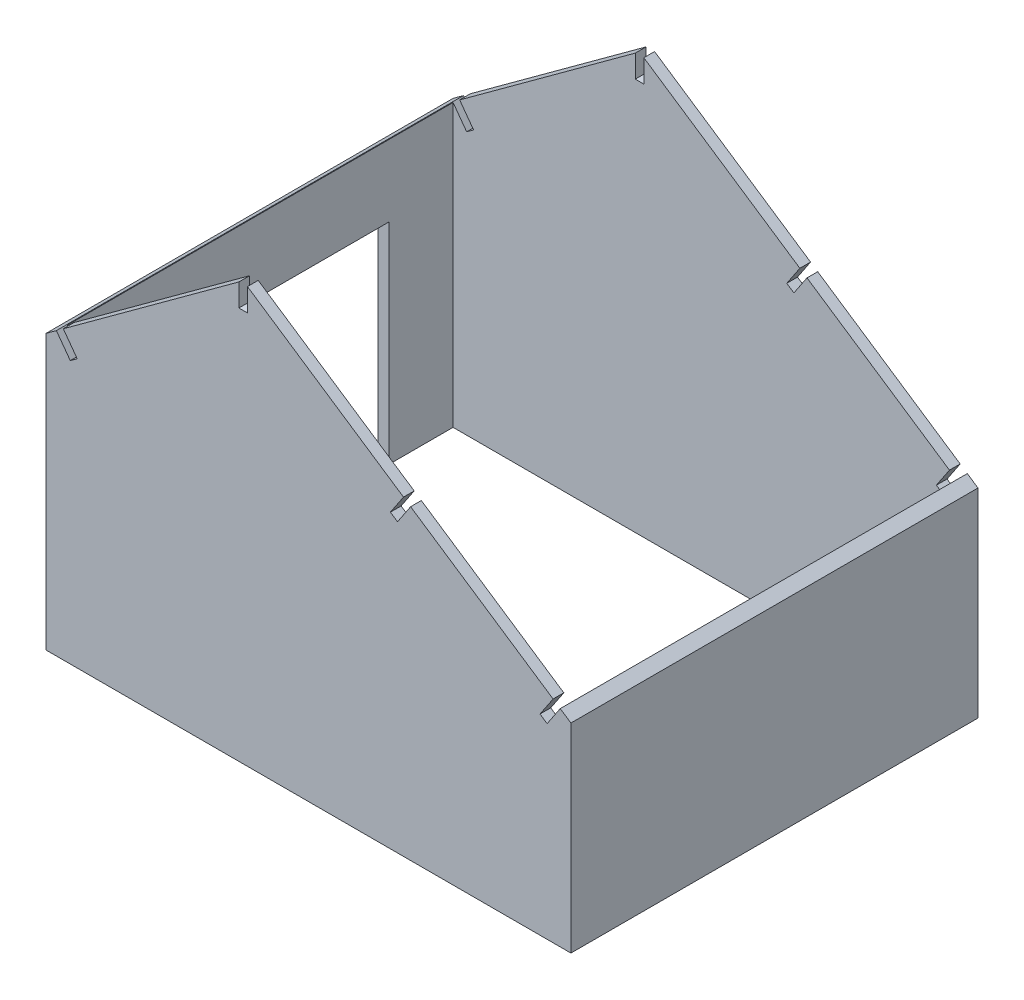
ISO-10303-21;
HEADER;
FILE_DESCRIPTION(('STEP AP214'),'2;1');
FILE_NAME('part.step','',(''),(''),'','','');
FILE_SCHEMA(('AUTOMOTIVE_DESIGN { 1 0 10303 214 1 1 1 1 }'));
ENDSEC;
DATA;
#1=APPLICATION_CONTEXT('core data for automotive mechanical design processes');
#2=APPLICATION_PROTOCOL_DEFINITION('international standard','automotive_design',2000,#1);
#3=PRODUCT_CONTEXT('',#1,'mechanical');
#4=PRODUCT('Part','Part','',(#3));
#5=PRODUCT_RELATED_PRODUCT_CATEGORY('part','',(#4));
#6=PRODUCT_DEFINITION_FORMATION('','',#4);
#7=PRODUCT_DEFINITION_CONTEXT('part definition',#1,'design');
#8=PRODUCT_DEFINITION('design','',#6,#7);
#9=PRODUCT_DEFINITION_SHAPE('','',#8);
#10=(LENGTH_UNIT() NAMED_UNIT(*) SI_UNIT(.MILLI.,.METRE.));
#11=(NAMED_UNIT(*) PLANE_ANGLE_UNIT() SI_UNIT($,.RADIAN.));
#12=(NAMED_UNIT(*) SI_UNIT($,.STERADIAN.) SOLID_ANGLE_UNIT());
#13=UNCERTAINTY_MEASURE_WITH_UNIT(LENGTH_MEASURE(1.E-05),#10,'distance_accuracy_value','');
#14=(GEOMETRIC_REPRESENTATION_CONTEXT(3) GLOBAL_UNCERTAINTY_ASSIGNED_CONTEXT((#13)) GLOBAL_UNIT_ASSIGNED_CONTEXT((#10,
#11,#12)) REPRESENTATION_CONTEXT('',''));
#15=CARTESIAN_POINT('',(0.,0.,0.));
#16=DIRECTION('',(0.,0.,1.));
#17=DIRECTION('',(1.,0.,0.));
#18=AXIS2_PLACEMENT_3D('',#15,#16,#17);
#19=CARTESIAN_POINT('',(152.961740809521,20.1138178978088,-5.));
#20=DIRECTION('',(0.555803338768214,0.831313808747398,0.));
#21=DIRECTION('',(-0.831313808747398,0.555803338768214,0.));
#22=AXIS2_PLACEMENT_3D('',#19,#20,#21);
#23=PLANE('',#22);
#24=DIRECTION('',(0.831313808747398,-0.555803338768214,0.));
#25=VECTOR('',#24,1.);
#26=CARTESIAN_POINT('',(147.961740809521,23.4567392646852,-190.));
#27=LINE('',#26,#25);
#28=CARTESIAN_POINT('',(2.00000000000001,121.04446368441,-190.));
#29=VERTEX_POINT('',#28);
#30=CARTESIAN_POINT('',(74.8182427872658,72.359331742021,-190.));
#31=VERTEX_POINT('',#30);
#32=EDGE_CURVE('E465',#29,#31,#27,.T.);
#33=ORIENTED_EDGE('',*,*,#32,.F.);
#34=DIRECTION('',(0.,0.,1.));
#35=VECTOR('',#34,1.);
#36=CARTESIAN_POINT('',(2.,121.04446368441,-5.));
#37=LINE('',#36,#35);
#38=CARTESIAN_POINT('',(2.,121.04446368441,-185.));
#39=VERTEX_POINT('',#38);
#40=EDGE_CURVE('E300',#29,#39,#37,.T.);
#41=ORIENTED_EDGE('',*,*,#40,.T.);
#42=DIRECTION('',(0.831313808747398,-0.555803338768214,0.));
#43=VECTOR('',#42,1.);
#44=CARTESIAN_POINT('',(147.961740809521,23.4567392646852,-185.));
#45=LINE('',#44,#43);
#46=CARTESIAN_POINT('',(74.8182427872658,72.359331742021,-185.));
#47=VERTEX_POINT('',#46);
#48=EDGE_CURVE('E456',#39,#47,#45,.T.);
#49=ORIENTED_EDGE('',*,*,#48,.T.);
#50=DIRECTION('',(0.,0.,1.));
#51=VECTOR('',#50,1.);
#52=CARTESIAN_POINT('',(74.8182427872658,72.359331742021,5.86249938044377));
#53=LINE('',#52,#51);
#54=EDGE_CURVE('E326',#31,#47,#53,.T.);
#55=ORIENTED_EDGE('',*,*,#54,.F.);
#56=EDGE_LOOP('',(#33,#41,#49,#55));
#57=FACE_BOUND('',#56,.T.);
#58=ADVANCED_FACE('F26',(#57),#23,.T.);
#59=CARTESIAN_POINT('',(0.,122.38163223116,-5.));
#60=DIRECTION('',(-0.590068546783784,0.807353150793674,0.));
#61=DIRECTION('',(-0.807353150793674,-0.590068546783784,0.));
#62=AXIS2_PLACEMENT_3D('',#59,#60,#61);
#63=PLANE('',#62);
#64=DIRECTION('',(-0.807353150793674,-0.590068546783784,0.));
#65=VECTOR('',#64,1.);
#66=CARTESIAN_POINT('',(0.,122.38163223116,0.));
#67=LINE('',#66,#65);
#68=CARTESIAN_POINT('',(-2.00000000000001,120.919896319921,0.));
#69=VERTEX_POINT('',#68);
#70=CARTESIAN_POINT('',(-83.9647276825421,61.0145033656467,0.));
#71=VERTEX_POINT('',#70);
#72=EDGE_CURVE('E681',#69,#71,#67,.T.);
#73=ORIENTED_EDGE('',*,*,#72,.F.);
#74=DIRECTION('',(0.,0.,-1.));
#75=VECTOR('',#74,1.);
#76=CARTESIAN_POINT('',(-2.00000000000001,120.919896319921,-5.));
#77=LINE('',#76,#75);
#78=CARTESIAN_POINT('',(-2.00000000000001,120.919896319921,-5.));
#79=VERTEX_POINT('',#78);
#80=EDGE_CURVE('E317',#69,#79,#77,.T.);
#81=ORIENTED_EDGE('',*,*,#80,.T.);
#82=DIRECTION('',(-0.807353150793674,-0.590068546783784,0.));
#83=VECTOR('',#82,1.);
#84=CARTESIAN_POINT('',(0.,122.38163223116,-5.));
#85=LINE('',#84,#83);
#86=CARTESIAN_POINT('',(-83.9647276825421,61.0145033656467,-5.));
#87=VERTEX_POINT('',#86);
#88=EDGE_CURVE('E315',#79,#87,#85,.T.);
#89=ORIENTED_EDGE('',*,*,#88,.T.);
#90=DIRECTION('',(0.,0.,-1.));
#91=VECTOR('',#90,1.);
#92=CARTESIAN_POINT('',(-83.9647276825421,61.0145033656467,4.99344607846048));
#93=LINE('',#92,#91);
#94=EDGE_CURVE('E394',#71,#87,#93,.T.);
#95=ORIENTED_EDGE('',*,*,#94,.F.);
#96=EDGE_LOOP('',(#73,#81,#89,#95));
#97=FACE_BOUND('',#96,.T.);
#98=ADVANCED_FACE('F702',(#97),#63,.T.);
#99=DIRECTION('',(0.807353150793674,0.590068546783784,0.));
#100=VECTOR('',#99,1.);
#101=CARTESIAN_POINT('',(0.,122.38163223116,-185.));
#102=LINE('',#101,#100);
#103=CARTESIAN_POINT('',(-83.9647276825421,61.0145033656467,-185.));
#104=VERTEX_POINT('',#103);
#105=CARTESIAN_POINT('',(-2.00000000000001,120.919896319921,-185.));
#106=VERTEX_POINT('',#105);
#107=EDGE_CURVE('E461',#104,#106,#102,.T.);
#108=ORIENTED_EDGE('',*,*,#107,.T.);
#109=DIRECTION('',(0.,0.,-1.));
#110=VECTOR('',#109,1.);
#111=CARTESIAN_POINT('',(-2.00000000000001,120.919896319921,-5.));
#112=LINE('',#111,#110);
#113=CARTESIAN_POINT('',(-2.00000000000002,120.919896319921,-190.));
#114=VERTEX_POINT('',#113);
#115=EDGE_CURVE('E567',#106,#114,#112,.T.);
#116=ORIENTED_EDGE('',*,*,#115,.T.);
#117=DIRECTION('',(0.807353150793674,0.590068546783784,0.));
#118=VECTOR('',#117,1.);
#119=CARTESIAN_POINT('',(-92.0382591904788,55.1138178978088,-190.));
#120=LINE('',#119,#118);
#121=CARTESIAN_POINT('',(-83.9647276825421,61.0145033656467,-190.));
#122=VERTEX_POINT('',#121);
#123=EDGE_CURVE('E477',#122,#114,#120,.T.);
#124=ORIENTED_EDGE('',*,*,#123,.F.);
#125=EDGE_CURVE('E392',#104,#122,#93,.T.);
#126=ORIENTED_EDGE('',*,*,#125,.F.);
#127=EDGE_LOOP('',(#108,#116,#124,#126));
#128=FACE_BOUND('',#127,.T.);
#129=ADVANCED_FACE('F575',(#128),#63,.T.);
#130=CARTESIAN_POINT('',(0.,122.38163223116,-5.));
#131=DIRECTION('',(0.,0.,-1.));
#132=DIRECTION('',(-1.,0.,0.));
#133=AXIS2_PLACEMENT_3D('',#130,#131,#132);
#134=PLANE('',#133);
#135=ORIENTED_EDGE('',*,*,#88,.F.);
#136=DIRECTION('',(0.,-1.,0.));
#137=VECTOR('',#136,1.);
#138=CARTESIAN_POINT('',(-2.00000000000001,122.38163223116,-5.));
#139=LINE('',#138,#137);
#140=CARTESIAN_POINT('',(-2.00000000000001,110.38163223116,-5.));
#141=VERTEX_POINT('',#140);
#142=EDGE_CURVE('E305',#79,#141,#139,.T.);
#143=ORIENTED_EDGE('',*,*,#142,.T.);
#144=DIRECTION('',(1.,0.,0.));
#145=VECTOR('',#144,1.);
#146=CARTESIAN_POINT('',(0.,110.38163223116,-5.));
#147=LINE('',#146,#145);
#148=CARTESIAN_POINT('',(1.99999999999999,110.38163223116,-5.));
#149=VERTEX_POINT('',#148);
#150=EDGE_CURVE('E293',#141,#149,#147,.T.);
#151=ORIENTED_EDGE('',*,*,#150,.T.);
#152=DIRECTION('',(0.,1.,0.));
#153=VECTOR('',#152,1.);
#154=CARTESIAN_POINT('',(1.99999999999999,122.38163223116,-5.));
#155=LINE('',#154,#153);
#156=CARTESIAN_POINT('',(2.,121.04446368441,-5.));
#157=VERTEX_POINT('',#156);
#158=EDGE_CURVE('E565',#149,#157,#155,.T.);
#159=ORIENTED_EDGE('',*,*,#158,.T.);
#160=DIRECTION('',(-0.831313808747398,0.555803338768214,0.));
#161=VECTOR('',#160,1.);
#162=CARTESIAN_POINT('',(152.961740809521,20.1138178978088,-5.));
#163=LINE('',#162,#161);
#164=CARTESIAN_POINT('',(74.8182427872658,72.359331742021,-5.));
#165=VERTEX_POINT('',#164);
#166=EDGE_CURVE('E509',#165,#157,#163,.T.);
#167=ORIENTED_EDGE('',*,*,#166,.F.);
#168=DIRECTION('',(0.555803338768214,0.831313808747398,0.));
#169=VECTOR('',#168,1.);
#170=CARTESIAN_POINT('',(74.8182427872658,72.359331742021,-5.));
#171=LINE('',#170,#169);
#172=CARTESIAN_POINT('',(68.7044060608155,63.2148798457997,-5.));
#173=VERTEX_POINT('',#172);
#174=EDGE_CURVE('E346',#173,#165,#171,.T.);
#175=ORIENTED_EDGE('',*,*,#174,.F.);
#176=DIRECTION('',(0.831313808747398,-0.555803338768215,0.));
#177=VECTOR('',#176,1.);
#178=CARTESIAN_POINT('',(-6.11383672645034,113.237180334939,-5.));
#179=LINE('',#178,#177);
#180=CARTESIAN_POINT('',(72.0296612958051,60.9916664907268,-5.));
#181=VERTEX_POINT('',#180);
#182=EDGE_CURVE('E338',#173,#181,#179,.T.);
#183=ORIENTED_EDGE('',*,*,#182,.T.);
#184=DIRECTION('',(-0.555803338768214,-0.831313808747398,0.));
#185=VECTOR('',#184,1.);
#186=CARTESIAN_POINT('',(78.1434980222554,70.1361183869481,-5.));
#187=LINE('',#186,#185);
#188=CARTESIAN_POINT('',(78.1434980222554,70.1361183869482,-5.));
#189=VERTEX_POINT('',#188);
#190=EDGE_CURVE('E353',#189,#181,#187,.T.);
#191=ORIENTED_EDGE('',*,*,#190,.F.);
#192=CARTESIAN_POINT('',(144.648602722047,25.671851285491,-5.));
#193=VERTEX_POINT('',#192);
#194=EDGE_CURVE('E522',#193,#189,#163,.T.);
#195=ORIENTED_EDGE('',*,*,#194,.F.);
#196=DIRECTION('',(0.555803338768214,0.831313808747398,0.));
#197=VECTOR('',#196,1.);
#198=CARTESIAN_POINT('',(144.648602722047,25.671851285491,-5.));
#199=LINE('',#198,#197);
#200=CARTESIAN_POINT('',(138.534765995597,16.5273993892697,-5.));
#201=VERTEX_POINT('',#200);
#202=EDGE_CURVE('E380',#201,#193,#199,.T.);
#203=ORIENTED_EDGE('',*,*,#202,.F.);
#204=DIRECTION('',(0.831313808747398,-0.555803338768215,0.));
#205=VECTOR('',#204,1.);
#206=CARTESIAN_POINT('',(-6.11383672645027,113.237180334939,-5.));
#207=LINE('',#206,#205);
#208=CARTESIAN_POINT('',(141.860021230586,14.3041860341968,-5.));
#209=VERTEX_POINT('',#208);
#210=EDGE_CURVE('E372',#201,#209,#207,.T.);
#211=ORIENTED_EDGE('',*,*,#210,.T.);
#212=DIRECTION('',(-0.555803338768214,-0.831313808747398,0.));
#213=VECTOR('',#212,1.);
#214=CARTESIAN_POINT('',(147.973857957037,23.4486379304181,-5.));
#215=LINE('',#214,#213);
#216=CARTESIAN_POINT('',(147.961740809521,23.4305143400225,-5.));
#217=VERTEX_POINT('',#216);
#218=EDGE_CURVE('E387',#217,#209,#215,.T.);
#219=ORIENTED_EDGE('',*,*,#218,.F.);
#220=DIRECTION('',(0.,1.,0.));
#221=VECTOR('',#220,1.);
#222=CARTESIAN_POINT('',(147.961740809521,23.4567392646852,-5.));
#223=LINE('',#222,#221);
#224=CARTESIAN_POINT('',(147.961740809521,-72.8861821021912,-5.));
#225=VERTEX_POINT('',#224);
#226=EDGE_CURVE('E489',#225,#217,#223,.T.);
#227=ORIENTED_EDGE('',*,*,#226,.F.);
#228=DIRECTION('',(1.,0.,0.));
#229=VECTOR('',#228,1.);
#230=CARTESIAN_POINT('',(-92.0382591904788,-72.8861821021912,-5.));
#231=LINE('',#230,#229);
#232=CARTESIAN_POINT('',(-87.0382591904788,-72.8861821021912,-5.));
#233=VERTEX_POINT('',#232);
#234=EDGE_CURVE('E506',#233,#225,#231,.T.);
#235=ORIENTED_EDGE('',*,*,#234,.F.);
#236=DIRECTION('',(0.,-1.,0.));
#237=VECTOR('',#236,1.);
#238=CARTESIAN_POINT('',(-87.0382591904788,58.7681576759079,-5.));
#239=LINE('',#238,#237);
#240=CARTESIAN_POINT('',(-87.0382591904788,58.4409470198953,-5.));
#241=VERTEX_POINT('',#240);
#242=EDGE_CURVE('E481',#241,#233,#239,.T.);
#243=ORIENTED_EDGE('',*,*,#242,.F.);
#244=DIRECTION('',(-0.590068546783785,0.807353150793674,0.));
#245=VECTOR('',#244,1.);
#246=CARTESIAN_POINT('',(-87.1941402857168,58.6542291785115,-5.));
#247=LINE('',#246,#245);
#248=CARTESIAN_POINT('',(-80.7033862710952,49.7733445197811,-5.));
#249=VERTEX_POINT('',#248);
#250=EDGE_CURVE('E417',#249,#241,#247,.T.);
#251=ORIENTED_EDGE('',*,*,#250,.F.);
#252=DIRECTION('',(0.807353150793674,0.590068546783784,0.));
#253=VECTOR('',#252,1.);
#254=CARTESIAN_POINT('',(6.49075401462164,113.50074757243,-5.));
#255=LINE('',#254,#253);
#256=CARTESIAN_POINT('',(-77.4739736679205,52.1336187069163,-5.));
#257=VERTEX_POINT('',#256);
#258=EDGE_CURVE('E409',#249,#257,#255,.T.);
#259=ORIENTED_EDGE('',*,*,#258,.T.);
#260=DIRECTION('',(0.590068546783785,-0.807353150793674,0.));
#261=VECTOR('',#260,1.);
#262=CARTESIAN_POINT('',(-83.9647276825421,61.0145033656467,-5.));
#263=LINE('',#262,#261);
#264=EDGE_CURVE('E427',#87,#257,#263,.T.);
#265=ORIENTED_EDGE('',*,*,#264,.F.);
#266=EDGE_LOOP('',(#135,#143,#151,#159,#167,#175,#183,#191,#195,#203,#211,#219,#227,#235,#243,
#251,#259,#265));
#267=FACE_BOUND('',#266,.T.);
#268=ADVANCED_FACE('F313',(#267),#134,.T.);
#269=ORIENTED_EDGE('',*,*,#166,.T.);
#270=DIRECTION('',(0.,0.,1.));
#271=VECTOR('',#270,1.);
#272=CARTESIAN_POINT('',(2.,121.04446368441,-5.));
#273=LINE('',#272,#271);
#274=CARTESIAN_POINT('',(2.,121.04446368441,0.));
#275=VERTEX_POINT('',#274);
#276=EDGE_CURVE('E562',#157,#275,#273,.T.);
#277=ORIENTED_EDGE('',*,*,#276,.T.);
#278=DIRECTION('',(-0.831313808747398,0.555803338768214,0.));
#279=VECTOR('',#278,1.);
#280=CARTESIAN_POINT('',(152.961740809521,20.1138178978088,0.));
#281=LINE('',#280,#279);
#282=CARTESIAN_POINT('',(74.8182427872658,72.359331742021,0.));
#283=VERTEX_POINT('',#282);
#284=EDGE_CURVE('E674',#283,#275,#281,.T.);
#285=ORIENTED_EDGE('',*,*,#284,.F.);
#286=EDGE_CURVE('E324',#165,#283,#53,.T.);
#287=ORIENTED_EDGE('',*,*,#286,.F.);
#288=EDGE_LOOP('',(#269,#277,#285,#287));
#289=FACE_BOUND('',#288,.T.);
#290=ADVANCED_FACE('F705',(#289),#23,.T.);
#291=CARTESIAN_POINT('',(0.,122.38163223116,0.));
#292=DIRECTION('',(0.,0.,-1.));
#293=DIRECTION('',(-1.,0.,0.));
#294=AXIS2_PLACEMENT_3D('',#291,#292,#293);
#295=PLANE('',#294);
#296=DIRECTION('',(0.,-1.,0.));
#297=VECTOR('',#296,1.);
#298=CARTESIAN_POINT('',(-2.00000000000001,122.38163223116,0.));
#299=LINE('',#298,#297);
#300=CARTESIAN_POINT('',(-2.00000000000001,110.38163223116,0.));
#301=VERTEX_POINT('',#300);
#302=EDGE_CURVE('E308',#69,#301,#299,.T.);
#303=ORIENTED_EDGE('',*,*,#302,.F.);
#304=ORIENTED_EDGE('',*,*,#72,.T.);
#305=DIRECTION('',(0.590068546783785,-0.807353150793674,0.));
#306=VECTOR('',#305,1.);
#307=CARTESIAN_POINT('',(-83.9647276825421,61.0145033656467,0.));
#308=LINE('',#307,#306);
#309=CARTESIAN_POINT('',(-77.4739736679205,52.1336187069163,0.));
#310=VERTEX_POINT('',#309);
#311=EDGE_CURVE('E424',#71,#310,#308,.T.);
#312=ORIENTED_EDGE('',*,*,#311,.T.);
#313=DIRECTION('',(0.807353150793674,0.590068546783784,0.));
#314=VECTOR('',#313,1.);
#315=CARTESIAN_POINT('',(6.49075401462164,113.50074757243,0.));
#316=LINE('',#315,#314);
#317=CARTESIAN_POINT('',(-80.7033862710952,49.7733445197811,0.));
#318=VERTEX_POINT('',#317);
#319=EDGE_CURVE('E407',#318,#310,#316,.T.);
#320=ORIENTED_EDGE('',*,*,#319,.F.);
#321=DIRECTION('',(-0.590068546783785,0.807353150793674,0.));
#322=VECTOR('',#321,1.);
#323=CARTESIAN_POINT('',(-87.1941402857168,58.6542291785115,0.));
#324=LINE('',#323,#322);
#325=CARTESIAN_POINT('',(-87.1941402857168,58.6542291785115,0.));
#326=VERTEX_POINT('',#325);
#327=EDGE_CURVE('E419',#318,#326,#324,.T.);
#328=ORIENTED_EDGE('',*,*,#327,.T.);
#329=CARTESIAN_POINT('',(-92.0382591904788,55.1138178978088,0.));
#330=VERTEX_POINT('',#329);
#331=EDGE_CURVE('E503',#326,#330,#67,.T.);
#332=ORIENTED_EDGE('',*,*,#331,.T.);
#333=DIRECTION('',(0.,-1.,0.));
#334=VECTOR('',#333,1.);
#335=CARTESIAN_POINT('',(-92.0382591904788,55.1138178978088,0.));
#336=LINE('',#335,#334);
#337=CARTESIAN_POINT('',(-92.0382591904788,-72.8861821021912,0.));
#338=VERTEX_POINT('',#337);
#339=EDGE_CURVE('E679',#330,#338,#336,.T.);
#340=ORIENTED_EDGE('',*,*,#339,.T.);
#341=DIRECTION('',(1.,0.,0.));
#342=VECTOR('',#341,1.);
#343=CARTESIAN_POINT('',(-92.0382591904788,-72.8861821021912,0.));
#344=LINE('',#343,#342);
#345=CARTESIAN_POINT('',(152.961740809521,-72.8861821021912,0.));
#346=VERTEX_POINT('',#345);
#347=EDGE_CURVE('E677',#338,#346,#344,.T.);
#348=ORIENTED_EDGE('',*,*,#347,.T.);
#349=DIRECTION('',(0.,1.,0.));
#350=VECTOR('',#349,1.);
#351=CARTESIAN_POINT('',(152.961740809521,-72.8861821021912,0.));
#352=LINE('',#351,#350);
#353=CARTESIAN_POINT('',(152.961740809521,20.1138178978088,0.));
#354=VERTEX_POINT('',#353);
#355=EDGE_CURVE('E631',#346,#354,#352,.T.);
#356=ORIENTED_EDGE('',*,*,#355,.T.);
#357=CARTESIAN_POINT('',(147.973857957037,23.4486379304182,0.));
#358=VERTEX_POINT('',#357);
#359=EDGE_CURVE('E625',#354,#358,#281,.T.);
#360=ORIENTED_EDGE('',*,*,#359,.T.);
#361=DIRECTION('',(-0.555803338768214,-0.831313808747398,0.));
#362=VECTOR('',#361,1.);
#363=CARTESIAN_POINT('',(147.973857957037,23.4486379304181,0.));
#364=LINE('',#363,#362);
#365=CARTESIAN_POINT('',(141.860021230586,14.3041860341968,0.));
#366=VERTEX_POINT('',#365);
#367=EDGE_CURVE('E389',#358,#366,#364,.T.);
#368=ORIENTED_EDGE('',*,*,#367,.T.);
#369=DIRECTION('',(0.831313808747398,-0.555803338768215,0.));
#370=VECTOR('',#369,1.);
#371=CARTESIAN_POINT('',(-6.11383672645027,113.237180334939,0.));
#372=LINE('',#371,#370);
#373=CARTESIAN_POINT('',(138.534765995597,16.5273993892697,0.));
#374=VERTEX_POINT('',#373);
#375=EDGE_CURVE('E370',#374,#366,#372,.T.);
#376=ORIENTED_EDGE('',*,*,#375,.F.);
#377=DIRECTION('',(0.555803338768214,0.831313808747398,0.));
#378=VECTOR('',#377,1.);
#379=CARTESIAN_POINT('',(144.648602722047,25.671851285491,0.));
#380=LINE('',#379,#378);
#381=CARTESIAN_POINT('',(144.648602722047,25.671851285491,0.));
#382=VERTEX_POINT('',#381);
#383=EDGE_CURVE('E377',#374,#382,#380,.T.);
#384=ORIENTED_EDGE('',*,*,#383,.T.);
#385=CARTESIAN_POINT('',(78.1434980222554,70.1361183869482,0.));
#386=VERTEX_POINT('',#385);
#387=EDGE_CURVE('E672',#382,#386,#281,.T.);
#388=ORIENTED_EDGE('',*,*,#387,.T.);
#389=DIRECTION('',(-0.555803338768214,-0.831313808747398,0.));
#390=VECTOR('',#389,1.);
#391=CARTESIAN_POINT('',(78.1434980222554,70.1361183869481,0.));
#392=LINE('',#391,#390);
#393=CARTESIAN_POINT('',(72.0296612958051,60.9916664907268,0.));
#394=VERTEX_POINT('',#393);
#395=EDGE_CURVE('E350',#386,#394,#392,.T.);
#396=ORIENTED_EDGE('',*,*,#395,.T.);
#397=DIRECTION('',(0.831313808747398,-0.555803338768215,0.));
#398=VECTOR('',#397,1.);
#399=CARTESIAN_POINT('',(-6.11383672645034,113.237180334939,0.));
#400=LINE('',#399,#398);
#401=CARTESIAN_POINT('',(68.7044060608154,63.2148798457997,0.));
#402=VERTEX_POINT('',#401);
#403=EDGE_CURVE('E336',#402,#394,#400,.T.);
#404=ORIENTED_EDGE('',*,*,#403,.F.);
#405=DIRECTION('',(0.555803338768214,0.831313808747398,0.));
#406=VECTOR('',#405,1.);
#407=CARTESIAN_POINT('',(74.8182427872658,72.359331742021,0.));
#408=LINE('',#407,#406);
#409=EDGE_CURVE('E343',#402,#283,#408,.T.);
#410=ORIENTED_EDGE('',*,*,#409,.T.);
#411=ORIENTED_EDGE('',*,*,#284,.T.);
#412=DIRECTION('',(0.,1.,0.));
#413=VECTOR('',#412,1.);
#414=CARTESIAN_POINT('',(1.99999999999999,122.38163223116,0.));
#415=LINE('',#414,#413);
#416=CARTESIAN_POINT('',(1.99999999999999,110.38163223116,0.));
#417=VERTEX_POINT('',#416);
#418=EDGE_CURVE('E560',#417,#275,#415,.T.);
#419=ORIENTED_EDGE('',*,*,#418,.F.);
#420=DIRECTION('',(1.,0.,0.));
#421=VECTOR('',#420,1.);
#422=CARTESIAN_POINT('',(0.,110.38163223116,0.));
#423=LINE('',#422,#421);
#424=EDGE_CURVE('E301',#301,#417,#423,.T.);
#425=ORIENTED_EDGE('',*,*,#424,.F.);
#426=EDGE_LOOP('',(#303,#304,#312,#320,#328,#332,#340,#348,#356,#360,#368,#376,#384,#388,#396,
#404,#410,#411,#419,#425));
#427=FACE_BOUND('',#426,.T.);
#428=ADVANCED_FACE('F669',(#427),#295,.F.);
#429=CARTESIAN_POINT('',(0.,122.38163223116,-185.));
#430=DIRECTION('',(0.,0.,1.));
#431=DIRECTION('',(1.,0.,0.));
#432=AXIS2_PLACEMENT_3D('',#429,#430,#431);
#433=PLANE('',#432);
#434=DIRECTION('',(-1.,0.,0.));
#435=VECTOR('',#434,1.);
#436=CARTESIAN_POINT('',(0.,110.38163223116,-185.));
#437=LINE('',#436,#435);
#438=CARTESIAN_POINT('',(1.99999999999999,110.38163223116,-185.));
#439=VERTEX_POINT('',#438);
#440=CARTESIAN_POINT('',(-2.00000000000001,110.38163223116,-185.));
#441=VERTEX_POINT('',#440);
#442=EDGE_CURVE('E554',#439,#441,#437,.T.);
#443=ORIENTED_EDGE('',*,*,#442,.T.);
#444=DIRECTION('',(0.,1.,0.));
#445=VECTOR('',#444,1.);
#446=CARTESIAN_POINT('',(-2.00000000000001,122.38163223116,-185.));
#447=LINE('',#446,#445);
#448=EDGE_CURVE('E551',#441,#106,#447,.T.);
#449=ORIENTED_EDGE('',*,*,#448,.T.);
#450=ORIENTED_EDGE('',*,*,#107,.F.);
#451=DIRECTION('',(-0.590068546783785,0.807353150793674,0.));
#452=VECTOR('',#451,1.);
#453=CARTESIAN_POINT('',(-83.9647276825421,61.0145033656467,-185.));
#454=LINE('',#453,#452);
#455=CARTESIAN_POINT('',(-77.4739736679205,52.1336187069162,-185.));
#456=VERTEX_POINT('',#455);
#457=EDGE_CURVE('E422',#456,#104,#454,.T.);
#458=ORIENTED_EDGE('',*,*,#457,.F.);
#459=DIRECTION('',(-0.807353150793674,-0.590068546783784,0.));
#460=VECTOR('',#459,1.);
#461=CARTESIAN_POINT('',(6.49075401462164,113.50074757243,-185.));
#462=LINE('',#461,#460);
#463=CARTESIAN_POINT('',(-80.7033862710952,49.7733445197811,-185.));
#464=VERTEX_POINT('',#463);
#465=EDGE_CURVE('E404',#456,#464,#462,.T.);
#466=ORIENTED_EDGE('',*,*,#465,.T.);
#467=DIRECTION('',(0.590068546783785,-0.807353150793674,0.));
#468=VECTOR('',#467,1.);
#469=CARTESIAN_POINT('',(-87.1941402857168,58.6542291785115,-185.));
#470=LINE('',#469,#468);
#471=CARTESIAN_POINT('',(-87.0382591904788,58.4409470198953,-185.));
#472=VERTEX_POINT('',#471);
#473=EDGE_CURVE('E412',#472,#464,#470,.T.);
#474=ORIENTED_EDGE('',*,*,#473,.F.);
#475=DIRECTION('',(0.,-1.,0.));
#476=VECTOR('',#475,1.);
#477=CARTESIAN_POINT('',(-87.0382591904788,58.7681576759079,-185.));
#478=LINE('',#477,#476);
#479=CARTESIAN_POINT('',(-87.0382591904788,-72.8861821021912,-185.));
#480=VERTEX_POINT('',#479);
#481=EDGE_CURVE('E483',#472,#480,#478,.T.);
#482=ORIENTED_EDGE('',*,*,#481,.T.);
#483=DIRECTION('',(-1.,0.,0.));
#484=VECTOR('',#483,1.);
#485=CARTESIAN_POINT('',(-87.0382591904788,-72.8861821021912,-185.));
#486=LINE('',#485,#484);
#487=CARTESIAN_POINT('',(147.961740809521,-72.8861821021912,-185.));
#488=VERTEX_POINT('',#487);
#489=EDGE_CURVE('E458',#488,#480,#486,.T.);
#490=ORIENTED_EDGE('',*,*,#489,.F.);
#491=DIRECTION('',(0.,1.,0.));
#492=VECTOR('',#491,1.);
#493=CARTESIAN_POINT('',(147.961740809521,23.4567392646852,-185.));
#494=LINE('',#493,#492);
#495=CARTESIAN_POINT('',(147.961740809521,23.4305143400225,-185.));
#496=VERTEX_POINT('',#495);
#497=EDGE_CURVE('E492',#488,#496,#494,.T.);
#498=ORIENTED_EDGE('',*,*,#497,.T.);
#499=DIRECTION('',(0.555803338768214,0.831313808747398,0.));
#500=VECTOR('',#499,1.);
#501=CARTESIAN_POINT('',(147.973857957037,23.4486379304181,-185.));
#502=LINE('',#501,#500);
#503=CARTESIAN_POINT('',(141.860021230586,14.3041860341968,-185.));
#504=VERTEX_POINT('',#503);
#505=EDGE_CURVE('E382',#504,#496,#502,.T.);
#506=ORIENTED_EDGE('',*,*,#505,.F.);
#507=DIRECTION('',(-0.831313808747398,0.555803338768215,0.));
#508=VECTOR('',#507,1.);
#509=CARTESIAN_POINT('',(-6.11383672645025,113.237180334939,-185.));
#510=LINE('',#509,#508);
#511=CARTESIAN_POINT('',(138.534765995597,16.5273993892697,-185.));
#512=VERTEX_POINT('',#511);
#513=EDGE_CURVE('E367',#504,#512,#510,.T.);
#514=ORIENTED_EDGE('',*,*,#513,.T.);
#515=DIRECTION('',(-0.555803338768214,-0.831313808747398,0.));
#516=VECTOR('',#515,1.);
#517=CARTESIAN_POINT('',(144.648602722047,25.671851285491,-185.));
#518=LINE('',#517,#516);
#519=CARTESIAN_POINT('',(144.648602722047,25.671851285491,-185.));
#520=VERTEX_POINT('',#519);
#521=EDGE_CURVE('E375',#520,#512,#518,.T.);
#522=ORIENTED_EDGE('',*,*,#521,.F.);
#523=CARTESIAN_POINT('',(78.1434980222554,70.1361183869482,-185.));
#524=VERTEX_POINT('',#523);
#525=EDGE_CURVE('E449',#524,#520,#45,.T.);
#526=ORIENTED_EDGE('',*,*,#525,.F.);
#527=DIRECTION('',(0.555803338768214,0.831313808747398,0.));
#528=VECTOR('',#527,1.);
#529=CARTESIAN_POINT('',(78.1434980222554,70.1361183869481,-185.));
#530=LINE('',#529,#528);
#531=CARTESIAN_POINT('',(72.029661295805,60.9916664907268,-185.));
#532=VERTEX_POINT('',#531);
#533=EDGE_CURVE('E348',#532,#524,#530,.T.);
#534=ORIENTED_EDGE('',*,*,#533,.F.);
#535=DIRECTION('',(-0.831313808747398,0.555803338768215,0.));
#536=VECTOR('',#535,1.);
#537=CARTESIAN_POINT('',(-6.11383672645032,113.237180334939,-185.));
#538=LINE('',#537,#536);
#539=CARTESIAN_POINT('',(68.7044060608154,63.2148798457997,-185.));
#540=VERTEX_POINT('',#539);
#541=EDGE_CURVE('E333',#532,#540,#538,.T.);
#542=ORIENTED_EDGE('',*,*,#541,.T.);
#543=DIRECTION('',(-0.555803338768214,-0.831313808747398,0.));
#544=VECTOR('',#543,1.);
#545=CARTESIAN_POINT('',(74.8182427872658,72.359331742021,-185.));
#546=LINE('',#545,#544);
#547=EDGE_CURVE('E341',#47,#540,#546,.T.);
#548=ORIENTED_EDGE('',*,*,#547,.F.);
#549=ORIENTED_EDGE('',*,*,#48,.F.);
#550=DIRECTION('',(0.,-1.,0.));
#551=VECTOR('',#550,1.);
#552=CARTESIAN_POINT('',(1.99999999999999,122.38163223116,-185.));
#553=LINE('',#552,#551);
#554=EDGE_CURVE('E558',#39,#439,#553,.T.);
#555=ORIENTED_EDGE('',*,*,#554,.T.);
#556=EDGE_LOOP('',(#443,#449,#450,#458,#466,#474,#482,#490,#498,#506,#514,#522,#526,#534,#542,
#548,#549,#555));
#557=FACE_BOUND('',#556,.T.);
#558=ADVANCED_FACE('F571',(#557),#433,.T.);
#559=CARTESIAN_POINT('',(0.,122.38163223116,-190.));
#560=DIRECTION('',(0.,0.,1.));
#561=DIRECTION('',(1.,0.,0.));
#562=AXIS2_PLACEMENT_3D('',#559,#560,#561);
#563=PLANE('',#562);
#564=DIRECTION('',(0.,1.,0.));
#565=VECTOR('',#564,1.);
#566=CARTESIAN_POINT('',(-2.00000000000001,122.38163223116,-190.));
#567=LINE('',#566,#565);
#568=CARTESIAN_POINT('',(-2.00000000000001,110.38163223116,-190.));
#569=VERTEX_POINT('',#568);
#570=EDGE_CURVE('E11',#569,#114,#567,.T.);
#571=ORIENTED_EDGE('',*,*,#570,.F.);
#572=DIRECTION('',(-1.,0.,0.));
#573=VECTOR('',#572,1.);
#574=CARTESIAN_POINT('',(0.,110.38163223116,-190.));
#575=LINE('',#574,#573);
#576=CARTESIAN_POINT('',(1.99999999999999,110.38163223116,-190.));
#577=VERTEX_POINT('',#576);
#578=EDGE_CURVE('E531',#577,#569,#575,.T.);
#579=ORIENTED_EDGE('',*,*,#578,.F.);
#580=DIRECTION('',(0.,-1.,0.));
#581=VECTOR('',#580,1.);
#582=CARTESIAN_POINT('',(1.99999999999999,122.38163223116,-190.));
#583=LINE('',#582,#581);
#584=EDGE_CURVE('E34',#29,#577,#583,.T.);
#585=ORIENTED_EDGE('',*,*,#584,.F.);
#586=ORIENTED_EDGE('',*,*,#32,.T.);
#587=DIRECTION('',(-0.555803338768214,-0.831313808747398,0.));
#588=VECTOR('',#587,1.);
#589=CARTESIAN_POINT('',(74.8182427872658,72.359331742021,-190.));
#590=LINE('',#589,#588);
#591=CARTESIAN_POINT('',(68.7044060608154,63.2148798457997,-190.));
#592=VERTEX_POINT('',#591);
#593=EDGE_CURVE('E598',#31,#592,#590,.T.);
#594=ORIENTED_EDGE('',*,*,#593,.T.);
#595=DIRECTION('',(-0.831313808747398,0.555803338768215,0.));
#596=VECTOR('',#595,1.);
#597=CARTESIAN_POINT('',(-6.11383672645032,113.237180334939,-190.));
#598=LINE('',#597,#596);
#599=CARTESIAN_POINT('',(72.0296612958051,60.9916664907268,-190.));
#600=VERTEX_POINT('',#599);
#601=EDGE_CURVE('E594',#600,#592,#598,.T.);
#602=ORIENTED_EDGE('',*,*,#601,.F.);
#603=DIRECTION('',(0.555803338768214,0.831313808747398,0.));
#604=VECTOR('',#603,1.);
#605=CARTESIAN_POINT('',(78.1434980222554,70.1361183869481,-190.));
#606=LINE('',#605,#604);
#607=CARTESIAN_POINT('',(78.1434980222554,70.1361183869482,-190.));
#608=VERTEX_POINT('',#607);
#609=EDGE_CURVE('E529',#600,#608,#606,.T.);
#610=ORIENTED_EDGE('',*,*,#609,.T.);
#611=CARTESIAN_POINT('',(144.648602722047,25.671851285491,-190.));
#612=VERTEX_POINT('',#611);
#613=EDGE_CURVE('E468',#608,#612,#27,.T.);
#614=ORIENTED_EDGE('',*,*,#613,.T.);
#615=DIRECTION('',(-0.555803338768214,-0.831313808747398,0.));
#616=VECTOR('',#615,1.);
#617=CARTESIAN_POINT('',(144.648602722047,25.671851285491,-190.));
#618=LINE('',#617,#616);
#619=CARTESIAN_POINT('',(138.534765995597,16.5273993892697,-190.));
#620=VERTEX_POINT('',#619);
#621=EDGE_CURVE('E588',#612,#620,#618,.T.);
#622=ORIENTED_EDGE('',*,*,#621,.T.);
#623=DIRECTION('',(-0.831313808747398,0.555803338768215,0.));
#624=VECTOR('',#623,1.);
#625=CARTESIAN_POINT('',(-6.11383672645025,113.237180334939,-190.));
#626=LINE('',#625,#624);
#627=CARTESIAN_POINT('',(141.860021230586,14.3041860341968,-190.));
#628=VERTEX_POINT('',#627);
#629=EDGE_CURVE('E585',#628,#620,#626,.T.);
#630=ORIENTED_EDGE('',*,*,#629,.F.);
#631=DIRECTION('',(0.555803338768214,0.831313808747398,0.));
#632=VECTOR('',#631,1.);
#633=CARTESIAN_POINT('',(147.973857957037,23.4486379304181,-190.));
#634=LINE('',#633,#632);
#635=CARTESIAN_POINT('',(147.973857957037,23.4486379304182,-190.));
#636=VERTEX_POINT('',#635);
#637=EDGE_CURVE('E592',#628,#636,#634,.T.);
#638=ORIENTED_EDGE('',*,*,#637,.T.);
#639=CARTESIAN_POINT('',(152.961740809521,20.1138178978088,-190.));
#640=VERTEX_POINT('',#639);
#641=EDGE_CURVE('E464',#636,#640,#27,.T.);
#642=ORIENTED_EDGE('',*,*,#641,.T.);
#643=DIRECTION('',(0.,-1.,0.));
#644=VECTOR('',#643,1.);
#645=CARTESIAN_POINT('',(152.961740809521,20.1138178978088,-190.));
#646=LINE('',#645,#644);
#647=CARTESIAN_POINT('',(152.961740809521,-72.8861821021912,-190.));
#648=VERTEX_POINT('',#647);
#649=EDGE_CURVE('E467',#640,#648,#646,.T.);
#650=ORIENTED_EDGE('',*,*,#649,.T.);
#651=DIRECTION('',(-1.,0.,0.));
#652=VECTOR('',#651,1.);
#653=CARTESIAN_POINT('',(152.961740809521,-72.8861821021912,-190.));
#654=LINE('',#653,#652);
#655=CARTESIAN_POINT('',(-92.0382591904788,-72.8861821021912,-190.));
#656=VERTEX_POINT('',#655);
#657=EDGE_CURVE('E471',#648,#656,#654,.T.);
#658=ORIENTED_EDGE('',*,*,#657,.T.);
#659=DIRECTION('',(0.,1.,0.));
#660=VECTOR('',#659,1.);
#661=CARTESIAN_POINT('',(-92.0382591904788,-72.8861821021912,-190.));
#662=LINE('',#661,#660);
#663=CARTESIAN_POINT('',(-92.0382591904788,55.1138178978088,-190.));
#664=VERTEX_POINT('',#663);
#665=EDGE_CURVE('E474',#656,#664,#662,.T.);
#666=ORIENTED_EDGE('',*,*,#665,.T.);
#667=CARTESIAN_POINT('',(-87.1941402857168,58.6542291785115,-190.));
#668=VERTEX_POINT('',#667);
#669=EDGE_CURVE('E478',#664,#668,#120,.T.);
#670=ORIENTED_EDGE('',*,*,#669,.T.);
#671=DIRECTION('',(0.590068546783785,-0.807353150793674,0.));
#672=VECTOR('',#671,1.);
#673=CARTESIAN_POINT('',(-87.1941402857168,58.6542291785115,-190.));
#674=LINE('',#673,#672);
#675=CARTESIAN_POINT('',(-80.7033862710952,49.7733445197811,-190.));
#676=VERTEX_POINT('',#675);
#677=EDGE_CURVE('E586',#668,#676,#674,.T.);
#678=ORIENTED_EDGE('',*,*,#677,.T.);
#679=DIRECTION('',(-0.807353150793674,-0.590068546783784,0.));
#680=VECTOR('',#679,1.);
#681=CARTESIAN_POINT('',(6.49075401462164,113.50074757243,-190.));
#682=LINE('',#681,#680);
#683=CARTESIAN_POINT('',(-77.4739736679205,52.1336187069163,-190.));
#684=VERTEX_POINT('',#683);
#685=EDGE_CURVE('E510',#684,#676,#682,.T.);
#686=ORIENTED_EDGE('',*,*,#685,.F.);
#687=DIRECTION('',(-0.590068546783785,0.807353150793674,0.));
#688=VECTOR('',#687,1.);
#689=CARTESIAN_POINT('',(-83.9647276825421,61.0145033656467,-190.));
#690=LINE('',#689,#688);
#691=EDGE_CURVE('E582',#684,#122,#690,.T.);
#692=ORIENTED_EDGE('',*,*,#691,.T.);
#693=ORIENTED_EDGE('',*,*,#123,.T.);
#694=EDGE_LOOP('',(#571,#579,#585,#586,#594,#602,#610,#614,#622,#630,#638,#642,#650,#658,#666,
#670,#678,#686,#692,#693));
#695=FACE_BOUND('',#694,.T.);
#696=ADVANCED_FACE('F541',(#695),#563,.F.);
#697=DIRECTION('',(0.,0.,-1.));
#698=VECTOR('',#697,1.);
#699=CARTESIAN_POINT('',(78.1434980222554,70.1361183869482,5.86249938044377));
#700=LINE('',#699,#698);
#701=EDGE_CURVE('E316',#524,#608,#700,.T.);
#702=ORIENTED_EDGE('',*,*,#701,.F.);
#703=ORIENTED_EDGE('',*,*,#525,.T.);
#704=DIRECTION('',(0.,0.,1.));
#705=VECTOR('',#704,1.);
#706=CARTESIAN_POINT('',(144.648602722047,25.671851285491,5.86249938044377));
#707=LINE('',#706,#705);
#708=EDGE_CURVE('E359',#612,#520,#707,.T.);
#709=ORIENTED_EDGE('',*,*,#708,.F.);
#710=ORIENTED_EDGE('',*,*,#613,.F.);
#711=EDGE_LOOP('',(#702,#703,#709,#710));
#712=FACE_BOUND('',#711,.T.);
#713=ADVANCED_FACE('F614',(#712),#23,.T.);
#714=EDGE_CURVE('E319',#386,#189,#700,.T.);
#715=ORIENTED_EDGE('',*,*,#714,.F.);
#716=ORIENTED_EDGE('',*,*,#387,.F.);
#717=EDGE_CURVE('E357',#193,#382,#707,.T.);
#718=ORIENTED_EDGE('',*,*,#717,.F.);
#719=ORIENTED_EDGE('',*,*,#194,.T.);
#720=EDGE_LOOP('',(#715,#716,#718,#719));
#721=FACE_BOUND('',#720,.T.);
#722=ADVANCED_FACE('F653',(#721),#23,.T.);
#723=DIRECTION('',(0.,0.,-1.));
#724=VECTOR('',#723,1.);
#725=CARTESIAN_POINT('',(147.973857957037,23.4486379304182,5.86249938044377));
#726=LINE('',#725,#724);
#727=EDGE_CURVE('E355',#358,#636,#726,.T.);
#728=ORIENTED_EDGE('',*,*,#727,.F.);
#729=ORIENTED_EDGE('',*,*,#359,.F.);
#730=DIRECTION('',(0.,0.,1.));
#731=VECTOR('',#730,1.);
#732=CARTESIAN_POINT('',(152.961740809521,20.1138178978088,-5.));
#733=LINE('',#732,#731);
#734=EDGE_CURVE('E518',#640,#354,#733,.T.);
#735=ORIENTED_EDGE('',*,*,#734,.F.);
#736=ORIENTED_EDGE('',*,*,#641,.F.);
#737=EDGE_LOOP('',(#728,#729,#735,#736));
#738=FACE_BOUND('',#737,.T.);
#739=ADVANCED_FACE('F623',(#738),#23,.T.);
#740=DIRECTION('',(0.,0.,1.));
#741=VECTOR('',#740,1.);
#742=CARTESIAN_POINT('',(-87.1941402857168,58.6542291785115,4.99344607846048));
#743=LINE('',#742,#741);
#744=EDGE_CURVE('E395',#668,#326,#743,.T.);
#745=ORIENTED_EDGE('',*,*,#744,.F.);
#746=ORIENTED_EDGE('',*,*,#669,.F.);
#747=DIRECTION('',(0.,0.,1.));
#748=VECTOR('',#747,1.);
#749=CARTESIAN_POINT('',(-92.0382591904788,55.1138178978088,-5.));
#750=LINE('',#749,#748);
#751=EDGE_CURVE('E498',#664,#330,#750,.T.);
#752=ORIENTED_EDGE('',*,*,#751,.T.);
#753=ORIENTED_EDGE('',*,*,#331,.F.);
#754=EDGE_LOOP('',(#745,#746,#752,#753));
#755=FACE_BOUND('',#754,.T.);
#756=ADVANCED_FACE('F28',(#755),#63,.T.);
#757=CARTESIAN_POINT('',(152.961740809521,-72.8861821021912,-5.));
#758=DIRECTION('',(1.,0.,0.));
#759=DIRECTION('',(0.,0.,-1.));
#760=AXIS2_PLACEMENT_3D('',#757,#758,#759);
#761=PLANE('',#760);
#762=ORIENTED_EDGE('',*,*,#355,.F.);
#763=DIRECTION('',(0.,0.,1.));
#764=VECTOR('',#763,1.);
#765=CARTESIAN_POINT('',(152.961740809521,-72.8861821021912,-5.));
#766=LINE('',#765,#764);
#767=EDGE_CURVE('E629',#648,#346,#766,.T.);
#768=ORIENTED_EDGE('',*,*,#767,.F.);
#769=ORIENTED_EDGE('',*,*,#649,.F.);
#770=ORIENTED_EDGE('',*,*,#734,.T.);
#771=EDGE_LOOP('',(#762,#768,#769,#770));
#772=FACE_BOUND('',#771,.T.);
#773=ADVANCED_FACE('F630',(#772),#761,.T.);
#774=CARTESIAN_POINT('',(-92.0382591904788,-72.8861821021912,-5.));
#775=DIRECTION('',(0.,-1.,0.));
#776=DIRECTION('',(1.,0.,0.));
#777=AXIS2_PLACEMENT_3D('',#774,#775,#776);
#778=PLANE('',#777);
#779=DIRECTION('',(-1.,0.,0.));
#780=VECTOR('',#779,1.);
#781=CARTESIAN_POINT('',(-87.0382591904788,-72.8861821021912,-35.));
#782=LINE('',#781,#780);
#783=CARTESIAN_POINT('',(-87.0382591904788,-72.8861821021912,-35.));
#784=VERTEX_POINT('',#783);
#785=CARTESIAN_POINT('',(-92.0382591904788,-72.8861821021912,-35.));
#786=VERTEX_POINT('',#785);
#787=EDGE_CURVE('E447',#784,#786,#782,.T.);
#788=ORIENTED_EDGE('',*,*,#787,.F.);
#789=DIRECTION('',(0.,0.,1.));
#790=VECTOR('',#789,1.);
#791=CARTESIAN_POINT('',(-87.0382591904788,-72.8861821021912,-185.));
#792=LINE('',#791,#790);
#793=EDGE_CURVE('E485',#784,#233,#792,.T.);
#794=ORIENTED_EDGE('',*,*,#793,.T.);
#795=ORIENTED_EDGE('',*,*,#234,.T.);
#796=DIRECTION('',(0.,0.,1.));
#797=VECTOR('',#796,1.);
#798=CARTESIAN_POINT('',(147.961740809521,-72.8861821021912,-185.));
#799=LINE('',#798,#797);
#800=EDGE_CURVE('E500',#488,#225,#799,.T.);
#801=ORIENTED_EDGE('',*,*,#800,.F.);
#802=ORIENTED_EDGE('',*,*,#489,.T.);
#803=CARTESIAN_POINT('',(-87.0382591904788,-72.8861821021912,-155.));
#804=VERTEX_POINT('',#803);
#805=EDGE_CURVE('E486',#480,#804,#792,.T.);
#806=ORIENTED_EDGE('',*,*,#805,.T.);
#807=DIRECTION('',(-1.,0.,0.));
#808=VECTOR('',#807,1.);
#809=CARTESIAN_POINT('',(-87.0382591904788,-72.8861821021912,-155.));
#810=LINE('',#809,#808);
#811=CARTESIAN_POINT('',(-92.0382591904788,-72.8861821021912,-155.));
#812=VERTEX_POINT('',#811);
#813=EDGE_CURVE('E450',#804,#812,#810,.T.);
#814=ORIENTED_EDGE('',*,*,#813,.T.);
#815=DIRECTION('',(0.,0.,1.));
#816=VECTOR('',#815,1.);
#817=CARTESIAN_POINT('',(-92.0382591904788,-72.8861821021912,-5.));
#818=LINE('',#817,#816);
#819=EDGE_CURVE('E635',#656,#812,#818,.T.);
#820=ORIENTED_EDGE('',*,*,#819,.F.);
#821=ORIENTED_EDGE('',*,*,#657,.F.);
#822=ORIENTED_EDGE('',*,*,#767,.T.);
#823=ORIENTED_EDGE('',*,*,#347,.F.);
#824=EDGE_CURVE('E637',#786,#338,#818,.T.);
#825=ORIENTED_EDGE('',*,*,#824,.F.);
#826=EDGE_LOOP('',(#788,#794,#795,#801,#802,#806,#814,#820,#821,#822,#823,#825));
#827=FACE_BOUND('',#826,.T.);
#828=ADVANCED_FACE('F691',(#827),#778,.T.);
#829=CARTESIAN_POINT('',(-92.0382591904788,55.1138178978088,-5.));
#830=DIRECTION('',(-1.,0.,0.));
#831=DIRECTION('',(0.,-1.,0.));
#832=AXIS2_PLACEMENT_3D('',#829,#830,#831);
#833=PLANE('',#832);
#834=DIRECTION('',(0.,1.,0.));
#835=VECTOR('',#834,1.);
#836=CARTESIAN_POINT('',(-92.0382591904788,-72.8861821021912,-35.));
#837=LINE('',#836,#835);
#838=CARTESIAN_POINT('',(-92.0382591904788,25.1138178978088,-35.));
#839=VERTEX_POINT('',#838);
#840=EDGE_CURVE('E429',#786,#839,#837,.T.);
#841=ORIENTED_EDGE('',*,*,#840,.F.);
#842=ORIENTED_EDGE('',*,*,#824,.T.);
#843=ORIENTED_EDGE('',*,*,#339,.F.);
#844=ORIENTED_EDGE('',*,*,#751,.F.);
#845=ORIENTED_EDGE('',*,*,#665,.F.);
#846=ORIENTED_EDGE('',*,*,#819,.T.);
#847=DIRECTION('',(0.,-1.,0.));
#848=VECTOR('',#847,1.);
#849=CARTESIAN_POINT('',(-92.0382591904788,-72.8861821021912,-155.));
#850=LINE('',#849,#848);
#851=CARTESIAN_POINT('',(-92.0382591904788,25.1138178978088,-155.));
#852=VERTEX_POINT('',#851);
#853=EDGE_CURVE('E435',#852,#812,#850,.T.);
#854=ORIENTED_EDGE('',*,*,#853,.F.);
#855=DIRECTION('',(0.,0.,-1.));
#856=VECTOR('',#855,1.);
#857=CARTESIAN_POINT('',(-92.0382591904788,25.1138178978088,-35.));
#858=LINE('',#857,#856);
#859=EDGE_CURVE('E432',#839,#852,#858,.T.);
#860=ORIENTED_EDGE('',*,*,#859,.F.);
#861=EDGE_LOOP('',(#841,#842,#843,#844,#845,#846,#854,#860));
#862=FACE_BOUND('',#861,.T.);
#863=ADVANCED_FACE('F687',(#862),#833,.T.);
#864=CARTESIAN_POINT('',(147.961740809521,23.4567392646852,-185.));
#865=DIRECTION('',(1.,0.,0.));
#866=DIRECTION('',(0.,0.,-1.));
#867=AXIS2_PLACEMENT_3D('',#864,#865,#866);
#868=PLANE('',#867);
#869=ORIENTED_EDGE('',*,*,#226,.T.);
#870=DIRECTION('',(0.,0.,-1.));
#871=VECTOR('',#870,1.);
#872=CARTESIAN_POINT('',(147.961740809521,23.4305143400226,-185.));
#873=LINE('',#872,#871);
#874=EDGE_CURVE('E384',#217,#496,#873,.T.);
#875=ORIENTED_EDGE('',*,*,#874,.T.);
#876=ORIENTED_EDGE('',*,*,#497,.F.);
#877=ORIENTED_EDGE('',*,*,#800,.T.);
#878=EDGE_LOOP('',(#869,#875,#876,#877));
#879=FACE_BOUND('',#878,.T.);
#880=ADVANCED_FACE('F690',(#879),#868,.F.);
#881=CARTESIAN_POINT('',(-87.0382591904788,58.7681576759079,-185.));
#882=DIRECTION('',(-1.,0.,0.));
#883=DIRECTION('',(0.,-1.,0.));
#884=AXIS2_PLACEMENT_3D('',#881,#882,#883);
#885=PLANE('',#884);
#886=ORIENTED_EDGE('',*,*,#481,.F.);
#887=DIRECTION('',(0.,0.,1.));
#888=VECTOR('',#887,1.);
#889=CARTESIAN_POINT('',(-87.0382591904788,58.4409470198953,-185.));
#890=LINE('',#889,#888);
#891=EDGE_CURVE('E414',#472,#241,#890,.T.);
#892=ORIENTED_EDGE('',*,*,#891,.T.);
#893=ORIENTED_EDGE('',*,*,#242,.T.);
#894=ORIENTED_EDGE('',*,*,#793,.F.);
#895=DIRECTION('',(0.,1.,0.));
#896=VECTOR('',#895,1.);
#897=CARTESIAN_POINT('',(-87.0382591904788,-72.8861821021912,-35.));
#898=LINE('',#897,#896);
#899=CARTESIAN_POINT('',(-87.0382591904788,25.1138178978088,-35.));
#900=VERTEX_POINT('',#899);
#901=EDGE_CURVE('E437',#784,#900,#898,.T.);
#902=ORIENTED_EDGE('',*,*,#901,.T.);
#903=DIRECTION('',(0.,0.,-1.));
#904=VECTOR('',#903,1.);
#905=CARTESIAN_POINT('',(-87.0382591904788,25.1138178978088,-35.));
#906=LINE('',#905,#904);
#907=CARTESIAN_POINT('',(-87.0382591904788,25.1138178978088,-155.));
#908=VERTEX_POINT('',#907);
#909=EDGE_CURVE('E440',#900,#908,#906,.T.);
#910=ORIENTED_EDGE('',*,*,#909,.T.);
#911=DIRECTION('',(0.,-1.,0.));
#912=VECTOR('',#911,1.);
#913=CARTESIAN_POINT('',(-87.0382591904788,-72.8861821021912,-155.));
#914=LINE('',#913,#912);
#915=EDGE_CURVE('E443',#908,#804,#914,.T.);
#916=ORIENTED_EDGE('',*,*,#915,.T.);
#917=ORIENTED_EDGE('',*,*,#805,.F.);
#918=EDGE_LOOP('',(#886,#892,#893,#894,#902,#910,#916,#917));
#919=FACE_BOUND('',#918,.T.);
#920=ADVANCED_FACE('F697',(#919),#885,.F.);
#921=CARTESIAN_POINT('',(-87.0382591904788,-72.8861821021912,-35.));
#922=DIRECTION('',(0.,0.,1.));
#923=DIRECTION('',(1.,0.,0.));
#924=AXIS2_PLACEMENT_3D('',#921,#922,#923);
#925=PLANE('',#924);
#926=ORIENTED_EDGE('',*,*,#840,.T.);
#927=DIRECTION('',(-1.,0.,0.));
#928=VECTOR('',#927,1.);
#929=CARTESIAN_POINT('',(-87.0382591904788,25.1138178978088,-35.));
#930=LINE('',#929,#928);
#931=EDGE_CURVE('E446',#900,#839,#930,.T.);
#932=ORIENTED_EDGE('',*,*,#931,.F.);
#933=ORIENTED_EDGE('',*,*,#901,.F.);
#934=ORIENTED_EDGE('',*,*,#787,.T.);
#935=EDGE_LOOP('',(#926,#932,#933,#934));
#936=FACE_BOUND('',#935,.T.);
#937=ADVANCED_FACE('F736',(#936),#925,.F.);
#938=CARTESIAN_POINT('',(-87.0382591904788,-72.8861821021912,-155.));
#939=DIRECTION('',(0.,0.,-1.));
#940=DIRECTION('',(-1.,0.,0.));
#941=AXIS2_PLACEMENT_3D('',#938,#939,#940);
#942=PLANE('',#941);
#943=ORIENTED_EDGE('',*,*,#853,.T.);
#944=ORIENTED_EDGE('',*,*,#813,.F.);
#945=ORIENTED_EDGE('',*,*,#915,.F.);
#946=DIRECTION('',(-1.,0.,0.));
#947=VECTOR('',#946,1.);
#948=CARTESIAN_POINT('',(-87.0382591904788,25.1138178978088,-155.));
#949=LINE('',#948,#947);
#950=EDGE_CURVE('E453',#908,#852,#949,.T.);
#951=ORIENTED_EDGE('',*,*,#950,.T.);
#952=EDGE_LOOP('',(#943,#944,#945,#951));
#953=FACE_BOUND('',#952,.T.);
#954=ADVANCED_FACE('F841',(#953),#942,.F.);
#955=CARTESIAN_POINT('',(-87.0382591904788,25.1138178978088,-35.));
#956=DIRECTION('',(0.,1.,0.));
#957=DIRECTION('',(-1.,0.,0.));
#958=AXIS2_PLACEMENT_3D('',#955,#956,#957);
#959=PLANE('',#958);
#960=ORIENTED_EDGE('',*,*,#859,.T.);
#961=ORIENTED_EDGE('',*,*,#950,.F.);
#962=ORIENTED_EDGE('',*,*,#909,.F.);
#963=ORIENTED_EDGE('',*,*,#931,.T.);
#964=EDGE_LOOP('',(#960,#961,#962,#963));
#965=FACE_BOUND('',#964,.T.);
#966=ADVANCED_FACE('F839',(#965),#959,.F.);
#967=CARTESIAN_POINT('',(-77.4739736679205,52.1336187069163,4.99344607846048));
#968=DIRECTION('',(0.807353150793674,0.590068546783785,0.));
#969=DIRECTION('',(-0.590068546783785,0.807353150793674,0.));
#970=AXIS2_PLACEMENT_3D('',#967,#968,#969);
#971=PLANE('',#970);
#972=ORIENTED_EDGE('',*,*,#264,.T.);
#973=DIRECTION('',(0.,0.,-1.));
#974=VECTOR('',#973,1.);
#975=CARTESIAN_POINT('',(-77.4739736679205,52.1336187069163,4.99344607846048));
#976=LINE('',#975,#974);
#977=EDGE_CURVE('E399',#310,#257,#976,.T.);
#978=ORIENTED_EDGE('',*,*,#977,.F.);
#979=ORIENTED_EDGE('',*,*,#311,.F.);
#980=ORIENTED_EDGE('',*,*,#94,.T.);
#981=EDGE_LOOP('',(#972,#978,#979,#980));
#982=FACE_BOUND('',#981,.T.);
#983=ADVANCED_FACE('F836',(#982),#971,.F.);
#984=ORIENTED_EDGE('',*,*,#457,.T.);
#985=ORIENTED_EDGE('',*,*,#125,.T.);
#986=ORIENTED_EDGE('',*,*,#691,.F.);
#987=EDGE_CURVE('E397',#456,#684,#976,.T.);
#988=ORIENTED_EDGE('',*,*,#987,.F.);
#989=EDGE_LOOP('',(#984,#985,#986,#988));
#990=FACE_BOUND('',#989,.T.);
#991=ADVANCED_FACE('F580',(#990),#971,.F.);
#992=CARTESIAN_POINT('',(-80.7033862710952,49.7733445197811,4.99344607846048));
#993=DIRECTION('',(-0.807353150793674,-0.590068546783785,0.));
#994=DIRECTION('',(0.590068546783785,-0.807353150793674,0.));
#995=AXIS2_PLACEMENT_3D('',#992,#993,#994);
#996=PLANE('',#995);
#997=DIRECTION('',(0.,0.,1.));
#998=VECTOR('',#997,1.);
#999=CARTESIAN_POINT('',(-80.7033862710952,49.7733445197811,4.99344607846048));
#1000=LINE('',#999,#998);
#1001=EDGE_CURVE('E400',#249,#318,#1000,.T.);
#1002=ORIENTED_EDGE('',*,*,#1001,.F.);
#1003=ORIENTED_EDGE('',*,*,#250,.T.);
#1004=ORIENTED_EDGE('',*,*,#891,.F.);
#1005=ORIENTED_EDGE('',*,*,#473,.T.);
#1006=EDGE_CURVE('E403',#676,#464,#1000,.T.);
#1007=ORIENTED_EDGE('',*,*,#1006,.F.);
#1008=ORIENTED_EDGE('',*,*,#677,.F.);
#1009=ORIENTED_EDGE('',*,*,#744,.T.);
#1010=ORIENTED_EDGE('',*,*,#327,.F.);
#1011=EDGE_LOOP('',(#1002,#1003,#1004,#1005,#1007,#1008,#1009,#1010));
#1012=FACE_BOUND('',#1011,.T.);
#1013=ADVANCED_FACE('F832',(#1012),#996,.F.);
#1014=CARTESIAN_POINT('',(-77.4739736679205,52.1336187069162,-203.688528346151));
#1015=DIRECTION('',(-0.590068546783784,0.807353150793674,0.));
#1016=DIRECTION('',(-0.807353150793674,-0.590068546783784,0.));
#1017=AXIS2_PLACEMENT_3D('',#1014,#1015,#1016);
#1018=PLANE('',#1017);
#1019=ORIENTED_EDGE('',*,*,#1001,.T.);
#1020=ORIENTED_EDGE('',*,*,#319,.T.);
#1021=ORIENTED_EDGE('',*,*,#977,.T.);
#1022=ORIENTED_EDGE('',*,*,#258,.F.);
#1023=EDGE_LOOP('',(#1019,#1020,#1021,#1022));
#1024=FACE_BOUND('',#1023,.T.);
#1025=ADVANCED_FACE('F829',(#1024),#1018,.T.);
#1026=ORIENTED_EDGE('',*,*,#987,.T.);
#1027=ORIENTED_EDGE('',*,*,#685,.T.);
#1028=ORIENTED_EDGE('',*,*,#1006,.T.);
#1029=ORIENTED_EDGE('',*,*,#465,.F.);
#1030=EDGE_LOOP('',(#1026,#1027,#1028,#1029));
#1031=FACE_BOUND('',#1030,.T.);
#1032=ADVANCED_FACE('F827',(#1031),#1018,.T.);
#1033=CARTESIAN_POINT('',(141.860021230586,14.3041860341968,5.86249938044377));
#1034=DIRECTION('',(0.831313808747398,-0.555803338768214,0.));
#1035=DIRECTION('',(0.555803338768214,0.831313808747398,0.));
#1036=AXIS2_PLACEMENT_3D('',#1033,#1034,#1035);
#1037=PLANE('',#1036);
#1038=ORIENTED_EDGE('',*,*,#727,.T.);
#1039=ORIENTED_EDGE('',*,*,#637,.F.);
#1040=DIRECTION('',(0.,0.,-1.));
#1041=VECTOR('',#1040,1.);
#1042=CARTESIAN_POINT('',(141.860021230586,14.3041860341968,5.86249938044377));
#1043=LINE('',#1042,#1041);
#1044=EDGE_CURVE('E360',#504,#628,#1043,.T.);
#1045=ORIENTED_EDGE('',*,*,#1044,.F.);
#1046=ORIENTED_EDGE('',*,*,#505,.T.);
#1047=ORIENTED_EDGE('',*,*,#874,.F.);
#1048=ORIENTED_EDGE('',*,*,#218,.T.);
#1049=EDGE_CURVE('E362',#366,#209,#1043,.T.);
#1050=ORIENTED_EDGE('',*,*,#1049,.F.);
#1051=ORIENTED_EDGE('',*,*,#367,.F.);
#1052=EDGE_LOOP('',(#1038,#1039,#1045,#1046,#1047,#1048,#1050,#1051));
#1053=FACE_BOUND('',#1052,.T.);
#1054=ADVANCED_FACE('F823',(#1053),#1037,.F.);
#1055=CARTESIAN_POINT('',(138.534765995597,16.5273993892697,5.86249938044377));
#1056=DIRECTION('',(-0.831313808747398,0.555803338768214,0.));
#1057=DIRECTION('',(-0.555803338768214,-0.831313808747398,0.));
#1058=AXIS2_PLACEMENT_3D('',#1055,#1056,#1057);
#1059=PLANE('',#1058);
#1060=ORIENTED_EDGE('',*,*,#202,.T.);
#1061=ORIENTED_EDGE('',*,*,#717,.T.);
#1062=ORIENTED_EDGE('',*,*,#383,.F.);
#1063=DIRECTION('',(0.,0.,1.));
#1064=VECTOR('',#1063,1.);
#1065=CARTESIAN_POINT('',(138.534765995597,16.5273993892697,5.86249938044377));
#1066=LINE('',#1065,#1064);
#1067=EDGE_CURVE('E363',#201,#374,#1066,.T.);
#1068=ORIENTED_EDGE('',*,*,#1067,.F.);
#1069=EDGE_LOOP('',(#1060,#1061,#1062,#1068));
#1070=FACE_BOUND('',#1069,.T.);
#1071=ADVANCED_FACE('F820',(#1070),#1059,.F.);
#1072=ORIENTED_EDGE('',*,*,#521,.T.);
#1073=EDGE_CURVE('E366',#620,#512,#1066,.T.);
#1074=ORIENTED_EDGE('',*,*,#1073,.F.);
#1075=ORIENTED_EDGE('',*,*,#621,.F.);
#1076=ORIENTED_EDGE('',*,*,#708,.T.);
#1077=EDGE_LOOP('',(#1072,#1074,#1075,#1076));
#1078=FACE_BOUND('',#1077,.T.);
#1079=ADVANCED_FACE('F818',(#1078),#1059,.F.);
#1080=CARTESIAN_POINT('',(141.860021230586,14.3041860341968,-203.026564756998));
#1081=DIRECTION('',(0.555803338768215,0.831313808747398,0.));
#1082=DIRECTION('',(-0.831313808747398,0.555803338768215,0.));
#1083=AXIS2_PLACEMENT_3D('',#1080,#1081,#1082);
#1084=PLANE('',#1083);
#1085=ORIENTED_EDGE('',*,*,#1067,.T.);
#1086=ORIENTED_EDGE('',*,*,#375,.T.);
#1087=ORIENTED_EDGE('',*,*,#1049,.T.);
#1088=ORIENTED_EDGE('',*,*,#210,.F.);
#1089=EDGE_LOOP('',(#1085,#1086,#1087,#1088));
#1090=FACE_BOUND('',#1089,.T.);
#1091=ADVANCED_FACE('F814',(#1090),#1084,.T.);
#1092=ORIENTED_EDGE('',*,*,#1044,.T.);
#1093=ORIENTED_EDGE('',*,*,#629,.T.);
#1094=ORIENTED_EDGE('',*,*,#1073,.T.);
#1095=ORIENTED_EDGE('',*,*,#513,.F.);
#1096=EDGE_LOOP('',(#1092,#1093,#1094,#1095));
#1097=FACE_BOUND('',#1096,.T.);
#1098=ADVANCED_FACE('F817',(#1097),#1084,.T.);
#1099=CARTESIAN_POINT('',(72.0296612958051,60.9916664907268,5.86249938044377));
#1100=DIRECTION('',(0.555803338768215,0.831313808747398,0.));
#1101=DIRECTION('',(-0.831313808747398,0.555803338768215,0.));
#1102=AXIS2_PLACEMENT_3D('',#1099,#1100,#1101);
#1103=PLANE('',#1102);
#1104=DIRECTION('',(0.,0.,-1.));
#1105=VECTOR('',#1104,1.);
#1106=CARTESIAN_POINT('',(72.0296612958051,60.9916664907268,5.86249938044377));
#1107=LINE('',#1106,#1105);
#1108=EDGE_CURVE('E327',#532,#600,#1107,.T.);
#1109=ORIENTED_EDGE('',*,*,#1108,.T.);
#1110=ORIENTED_EDGE('',*,*,#601,.T.);
#1111=DIRECTION('',(0.,0.,1.));
#1112=VECTOR('',#1111,1.);
#1113=CARTESIAN_POINT('',(68.7044060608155,63.2148798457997,5.86249938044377));
#1114=LINE('',#1113,#1112);
#1115=EDGE_CURVE('E332',#592,#540,#1114,.T.);
#1116=ORIENTED_EDGE('',*,*,#1115,.T.);
#1117=ORIENTED_EDGE('',*,*,#541,.F.);
#1118=EDGE_LOOP('',(#1109,#1110,#1116,#1117));
#1119=FACE_BOUND('',#1118,.T.);
#1120=ADVANCED_FACE('F806',(#1119),#1103,.T.);
#1121=CARTESIAN_POINT('',(68.7044060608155,63.2148798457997,5.86249938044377));
#1122=DIRECTION('',(-0.831313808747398,0.555803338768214,0.));
#1123=DIRECTION('',(-0.555803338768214,-0.831313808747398,0.));
#1124=AXIS2_PLACEMENT_3D('',#1121,#1122,#1123);
#1125=PLANE('',#1124);
#1126=ORIENTED_EDGE('',*,*,#547,.T.);
#1127=ORIENTED_EDGE('',*,*,#1115,.F.);
#1128=ORIENTED_EDGE('',*,*,#593,.F.);
#1129=ORIENTED_EDGE('',*,*,#54,.T.);
#1130=EDGE_LOOP('',(#1126,#1127,#1128,#1129));
#1131=FACE_BOUND('',#1130,.T.);
#1132=ADVANCED_FACE('F810',(#1131),#1125,.F.);
#1133=CARTESIAN_POINT('',(72.0296612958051,60.9916664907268,5.86249938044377));
#1134=DIRECTION('',(0.831313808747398,-0.555803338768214,0.));
#1135=DIRECTION('',(0.555803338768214,0.831313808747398,0.));
#1136=AXIS2_PLACEMENT_3D('',#1133,#1134,#1135);
#1137=PLANE('',#1136);
#1138=ORIENTED_EDGE('',*,*,#533,.T.);
#1139=ORIENTED_EDGE('',*,*,#701,.T.);
#1140=ORIENTED_EDGE('',*,*,#609,.F.);
#1141=ORIENTED_EDGE('',*,*,#1108,.F.);
#1142=EDGE_LOOP('',(#1138,#1139,#1140,#1141));
#1143=FACE_BOUND('',#1142,.T.);
#1144=ADVANCED_FACE('F813',(#1143),#1137,.F.);
#1145=ORIENTED_EDGE('',*,*,#190,.T.);
#1146=EDGE_CURVE('E329',#394,#181,#1107,.T.);
#1147=ORIENTED_EDGE('',*,*,#1146,.F.);
#1148=ORIENTED_EDGE('',*,*,#395,.F.);
#1149=ORIENTED_EDGE('',*,*,#714,.T.);
#1150=EDGE_LOOP('',(#1145,#1147,#1148,#1149));
#1151=FACE_BOUND('',#1150,.T.);
#1152=ADVANCED_FACE('F662',(#1151),#1137,.F.);
#1153=ORIENTED_EDGE('',*,*,#174,.T.);
#1154=ORIENTED_EDGE('',*,*,#286,.T.);
#1155=ORIENTED_EDGE('',*,*,#409,.F.);
#1156=EDGE_CURVE('E330',#173,#402,#1114,.T.);
#1157=ORIENTED_EDGE('',*,*,#1156,.F.);
#1158=EDGE_LOOP('',(#1153,#1154,#1155,#1157));
#1159=FACE_BOUND('',#1158,.T.);
#1160=ADVANCED_FACE('F805',(#1159),#1125,.F.);
#1161=ORIENTED_EDGE('',*,*,#1156,.T.);
#1162=ORIENTED_EDGE('',*,*,#403,.T.);
#1163=ORIENTED_EDGE('',*,*,#1146,.T.);
#1164=ORIENTED_EDGE('',*,*,#182,.F.);
#1165=EDGE_LOOP('',(#1161,#1162,#1163,#1164));
#1166=FACE_BOUND('',#1165,.T.);
#1167=ADVANCED_FACE('F664',(#1166),#1103,.T.);
#1168=CARTESIAN_POINT('',(-2.00000000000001,110.38163223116,7.40643648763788));
#1169=DIRECTION('',(0.,1.,0.));
#1170=DIRECTION('',(0.,0.,1.));
#1171=AXIS2_PLACEMENT_3D('',#1168,#1169,#1170);
#1172=PLANE('',#1171);
#1173=DIRECTION('',(0.,0.,1.));
#1174=VECTOR('',#1173,1.);
#1175=CARTESIAN_POINT('',(1.99999999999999,110.38163223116,-194.793194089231));
#1176=LINE('',#1175,#1174);
#1177=EDGE_CURVE('E49',#577,#439,#1176,.T.);
#1178=ORIENTED_EDGE('',*,*,#1177,.F.);
#1179=ORIENTED_EDGE('',*,*,#578,.T.);
#1180=DIRECTION('',(0.,0.,-1.));
#1181=VECTOR('',#1180,1.);
#1182=CARTESIAN_POINT('',(-2.00000000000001,110.38163223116,-194.793194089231));
#1183=LINE('',#1182,#1181);
#1184=EDGE_CURVE('E310',#441,#569,#1183,.T.);
#1185=ORIENTED_EDGE('',*,*,#1184,.F.);
#1186=ORIENTED_EDGE('',*,*,#442,.F.);
#1187=EDGE_LOOP('',(#1178,#1179,#1185,#1186));
#1188=FACE_BOUND('',#1187,.T.);
#1189=ADVANCED_FACE('F545',(#1188),#1172,.T.);
#1190=CARTESIAN_POINT('',(1.99999999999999,110.38163223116,-194.793194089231));
#1191=DIRECTION('',(-1.,0.,0.));
#1192=DIRECTION('',(0.,-1.,0.));
#1193=AXIS2_PLACEMENT_3D('',#1190,#1191,#1192);
#1194=PLANE('',#1193);
#1195=ORIENTED_EDGE('',*,*,#40,.F.);
#1196=ORIENTED_EDGE('',*,*,#584,.T.);
#1197=ORIENTED_EDGE('',*,*,#1177,.T.);
#1198=ORIENTED_EDGE('',*,*,#554,.F.);
#1199=EDGE_LOOP('',(#1195,#1196,#1197,#1198));
#1200=FACE_BOUND('',#1199,.T.);
#1201=ADVANCED_FACE('F535',(#1200),#1194,.T.);
#1202=CARTESIAN_POINT('',(-2.00000000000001,110.38163223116,-194.793194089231));
#1203=DIRECTION('',(1.,0.,0.));
#1204=DIRECTION('',(0.,1.,0.));
#1205=AXIS2_PLACEMENT_3D('',#1202,#1203,#1204);
#1206=PLANE('',#1205);
#1207=ORIENTED_EDGE('',*,*,#1184,.T.);
#1208=ORIENTED_EDGE('',*,*,#570,.T.);
#1209=ORIENTED_EDGE('',*,*,#115,.F.);
#1210=ORIENTED_EDGE('',*,*,#448,.F.);
#1211=EDGE_LOOP('',(#1207,#1208,#1209,#1210));
#1212=FACE_BOUND('',#1211,.T.);
#1213=ADVANCED_FACE('F548',(#1212),#1206,.T.);
#1214=ORIENTED_EDGE('',*,*,#80,.F.);
#1215=ORIENTED_EDGE('',*,*,#302,.T.);
#1216=EDGE_CURVE('E41',#301,#141,#1183,.T.);
#1217=ORIENTED_EDGE('',*,*,#1216,.T.);
#1218=ORIENTED_EDGE('',*,*,#142,.F.);
#1219=EDGE_LOOP('',(#1214,#1215,#1217,#1218));
#1220=FACE_BOUND('',#1219,.T.);
#1221=ADVANCED_FACE('F304',(#1220),#1206,.T.);
#1222=EDGE_CURVE('E296',#149,#417,#1176,.T.);
#1223=ORIENTED_EDGE('',*,*,#1222,.T.);
#1224=ORIENTED_EDGE('',*,*,#418,.T.);
#1225=ORIENTED_EDGE('',*,*,#276,.F.);
#1226=ORIENTED_EDGE('',*,*,#158,.F.);
#1227=EDGE_LOOP('',(#1223,#1224,#1225,#1226));
#1228=FACE_BOUND('',#1227,.T.);
#1229=ADVANCED_FACE('F780',(#1228),#1194,.T.);
#1230=ORIENTED_EDGE('',*,*,#1216,.F.);
#1231=ORIENTED_EDGE('',*,*,#424,.T.);
#1232=ORIENTED_EDGE('',*,*,#1222,.F.);
#1233=ORIENTED_EDGE('',*,*,#150,.F.);
#1234=EDGE_LOOP('',(#1230,#1231,#1232,#1233));
#1235=FACE_BOUND('',#1234,.T.);
#1236=ADVANCED_FACE('F294',(#1235),#1172,.T.);
#1237=CLOSED_SHELL('',(#58,#98,#129,#268,#290,#428,#558,#696,#713,#722,#739,#756,#773,#828,#863,
#880,#920,#937,#954,#966,#983,#991,#1013,#1025,#1032,#1054,#1071,#1079,#1091,#1098,#1120,#1132,
#1144,#1152,#1160,#1167,#1189,#1201,#1213,#1221,#1229,#1236));
#1238=MANIFOLD_SOLID_BREP('B2',#1237);
#1239=ADVANCED_BREP_SHAPE_REPRESENTATION('',(#18,#1238),#14);
#1240=SHAPE_DEFINITION_REPRESENTATION(#9,#1239);
ENDSEC;
END-ISO-10303-21;
